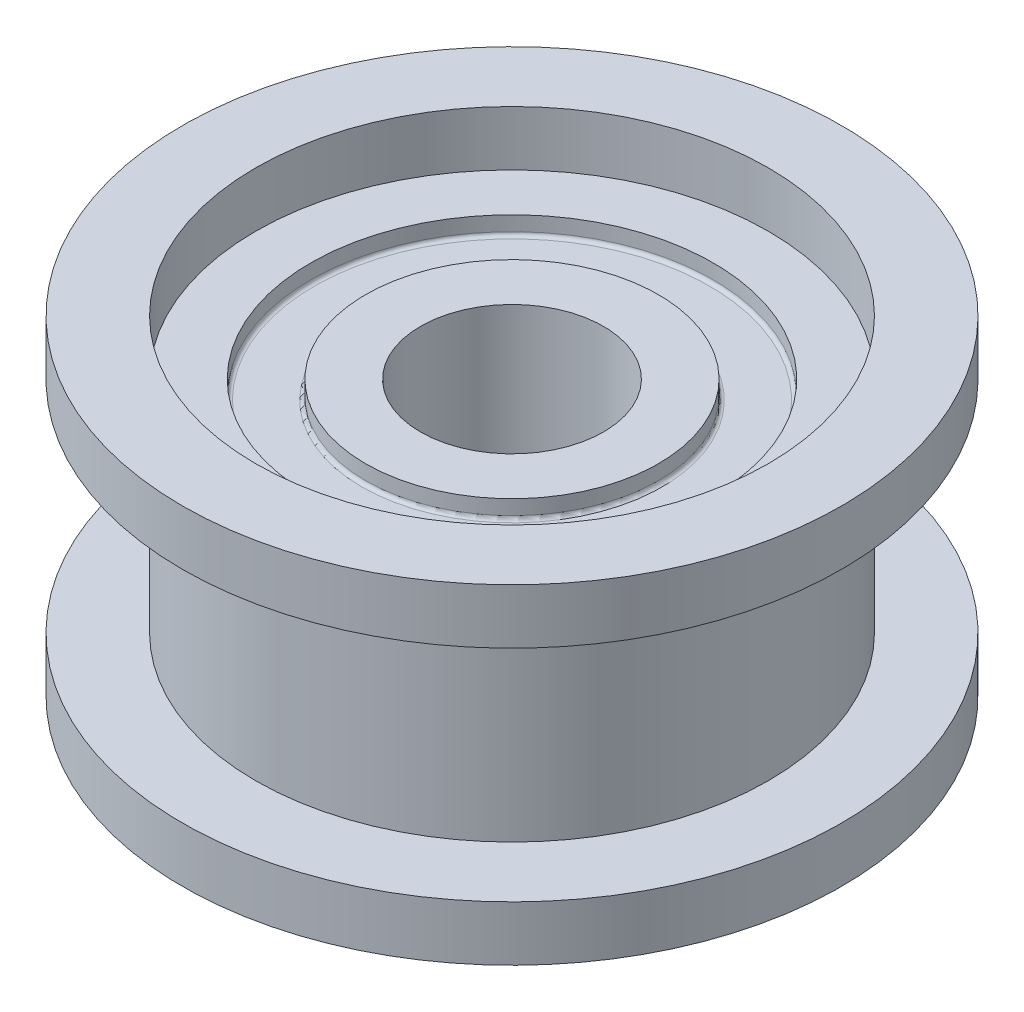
ISO-10303-21;
HEADER;
FILE_DESCRIPTION(('STEP AP214'),'2;1');
FILE_NAME('part.step','',(''),(''),'','','');
FILE_SCHEMA(('AUTOMOTIVE_DESIGN { 1 0 10303 214 1 1 1 1 }'));
ENDSEC;
DATA;
#1=APPLICATION_CONTEXT('core data for automotive mechanical design processes');
#2=APPLICATION_PROTOCOL_DEFINITION('international standard','automotive_design',2000,#1);
#3=PRODUCT_CONTEXT('',#1,'mechanical');
#4=PRODUCT('Part','Part','',(#3));
#5=PRODUCT_RELATED_PRODUCT_CATEGORY('part','',(#4));
#6=PRODUCT_DEFINITION_FORMATION('','',#4);
#7=PRODUCT_DEFINITION_CONTEXT('part definition',#1,'design');
#8=PRODUCT_DEFINITION('design','',#6,#7);
#9=PRODUCT_DEFINITION_SHAPE('','',#8);
#10=(LENGTH_UNIT() NAMED_UNIT(*) SI_UNIT(.MILLI.,.METRE.));
#11=(NAMED_UNIT(*) PLANE_ANGLE_UNIT() SI_UNIT($,.RADIAN.));
#12=(NAMED_UNIT(*) SI_UNIT($,.STERADIAN.) SOLID_ANGLE_UNIT());
#13=UNCERTAINTY_MEASURE_WITH_UNIT(LENGTH_MEASURE(1.E-05),#10,'distance_accuracy_value','');
#14=(GEOMETRIC_REPRESENTATION_CONTEXT(3) GLOBAL_UNCERTAINTY_ASSIGNED_CONTEXT((#13)) GLOBAL_UNIT_ASSIGNED_CONTEXT((#10,
#11,#12)) REPRESENTATION_CONTEXT('',''));
#15=CARTESIAN_POINT('',(0.,0.,0.));
#16=DIRECTION('',(0.,0.,1.));
#17=DIRECTION('',(1.,0.,0.));
#18=AXIS2_PLACEMENT_3D('',#15,#16,#17);
#19=CARTESIAN_POINT('',(0.,7.5,0.));
#20=DIRECTION('',(0.,1.,0.));
#21=DIRECTION('',(0.,0.,1.));
#22=AXIS2_PLACEMENT_3D('',#19,#20,#21);
#23=PLANE('',#22);
#24=CARTESIAN_POINT('',(0.,7.5,0.));
#25=DIRECTION('',(0.,1.,0.));
#26=DIRECTION('',(0.,0.,1.));
#27=AXIS2_PLACEMENT_3D('',#24,#25,#26);
#28=CIRCLE('',#27,9.);
#29=CARTESIAN_POINT('',(0.,7.5,9.));
#30=VERTEX_POINT('',#29);
#31=EDGE_CURVE('E11',#30,#30,#28,.T.);
#32=ORIENTED_EDGE('',*,*,#31,.T.);
#33=EDGE_LOOP('',(#32));
#34=FACE_BOUND('',#33,.T.);
#35=CARTESIAN_POINT('',(0.,7.5,0.));
#36=DIRECTION('',(0.,1.,0.));
#37=DIRECTION('',(0.,0.,1.));
#38=AXIS2_PLACEMENT_3D('',#35,#36,#37);
#39=CIRCLE('',#38,7.);
#40=CARTESIAN_POINT('',(0.,7.5,7.));
#41=VERTEX_POINT('',#40);
#42=EDGE_CURVE('E53',#41,#41,#39,.T.);
#43=ORIENTED_EDGE('',*,*,#42,.F.);
#44=EDGE_LOOP('',(#43));
#45=FACE_BOUND('',#44,.T.);
#46=ADVANCED_FACE('F42',(#34,#45),#23,.T.);
#47=CARTESIAN_POINT('',(0.,6.,0.));
#48=DIRECTION('',(0.,1.,0.));
#49=DIRECTION('',(0.,0.,1.));
#50=AXIS2_PLACEMENT_3D('',#47,#48,#49);
#51=PLANE('',#50);
#52=CARTESIAN_POINT('',(0.,6.,0.));
#53=DIRECTION('',(0.,1.,0.));
#54=DIRECTION('',(0.,0.,1.));
#55=AXIS2_PLACEMENT_3D('',#52,#53,#54);
#56=CIRCLE('',#55,9.);
#57=CARTESIAN_POINT('',(0.,6.,9.));
#58=VERTEX_POINT('',#57);
#59=EDGE_CURVE('E46',#58,#58,#56,.T.);
#60=ORIENTED_EDGE('',*,*,#59,.F.);
#61=EDGE_LOOP('',(#60));
#62=FACE_BOUND('',#61,.T.);
#63=CARTESIAN_POINT('',(0.,6.,0.));
#64=DIRECTION('',(0.,1.,0.));
#65=DIRECTION('',(0.,0.,1.));
#66=AXIS2_PLACEMENT_3D('',#63,#64,#65);
#67=CIRCLE('',#66,7.);
#68=CARTESIAN_POINT('',(0.,6.,7.));
#69=VERTEX_POINT('',#68);
#70=EDGE_CURVE('E55',#69,#69,#67,.T.);
#71=ORIENTED_EDGE('',*,*,#70,.T.);
#72=EDGE_LOOP('',(#71));
#73=FACE_BOUND('',#72,.T.);
#74=ADVANCED_FACE('F65',(#62,#73),#51,.F.);
#75=CARTESIAN_POINT('',(0.,7.5,0.));
#76=DIRECTION('',(0.,-1.,0.));
#77=DIRECTION('',(0.,0.,-1.));
#78=AXIS2_PLACEMENT_3D('',#75,#76,#77);
#79=CYLINDRICAL_SURFACE('',#78,9.);
#80=ORIENTED_EDGE('',*,*,#31,.F.);
#81=EDGE_LOOP('',(#80));
#82=FACE_BOUND('',#81,.T.);
#83=ORIENTED_EDGE('',*,*,#59,.T.);
#84=EDGE_LOOP('',(#83));
#85=FACE_BOUND('',#84,.T.);
#86=ADVANCED_FACE('F44',(#82,#85),#79,.T.);
#87=CARTESIAN_POINT('',(0.,7.5,0.));
#88=DIRECTION('',(0.,-1.,0.));
#89=DIRECTION('',(0.,0.,-1.));
#90=AXIS2_PLACEMENT_3D('',#87,#88,#89);
#91=CYLINDRICAL_SURFACE('',#90,7.);
#92=ORIENTED_EDGE('',*,*,#42,.T.);
#93=EDGE_LOOP('',(#92));
#94=FACE_BOUND('',#93,.T.);
#95=ORIENTED_EDGE('',*,*,#70,.F.);
#96=EDGE_LOOP('',(#95));
#97=FACE_BOUND('',#96,.T.);
#98=ADVANCED_FACE('F61',(#94,#97),#91,.F.);
#99=CLOSED_SHELL('',(#46,#74,#86,#98));
#100=MANIFOLD_SOLID_BREP('B2',#99);
#101=CARTESIAN_POINT('',(0.,0.,0.));
#102=DIRECTION('',(0.,1.,0.));
#103=DIRECTION('',(0.,0.,1.));
#104=AXIS2_PLACEMENT_3D('',#101,#102,#103);
#105=PLANE('',#104);
#106=CARTESIAN_POINT('',(0.,0.,0.));
#107=DIRECTION('',(0.,1.,0.));
#108=DIRECTION('',(0.,0.,1.));
#109=AXIS2_PLACEMENT_3D('',#106,#107,#108);
#110=CIRCLE('',#109,2.5);
#111=CARTESIAN_POINT('',(0.,0.,2.5));
#112=VERTEX_POINT('',#111);
#113=EDGE_CURVE('E139',#112,#112,#110,.T.);
#114=ORIENTED_EDGE('',*,*,#113,.T.);
#115=EDGE_LOOP('',(#114));
#116=FACE_BOUND('',#115,.T.);
#117=CARTESIAN_POINT('',(0.,0.,0.));
#118=DIRECTION('',(0.,-1.,0.));
#119=DIRECTION('',(0.,0.,-1.));
#120=AXIS2_PLACEMENT_3D('',#117,#118,#119);
#121=CIRCLE('',#120,4.);
#122=CARTESIAN_POINT('',(0.,0.,-4.));
#123=VERTEX_POINT('',#122);
#124=EDGE_CURVE('E150',#123,#123,#121,.T.);
#125=ORIENTED_EDGE('',*,*,#124,.T.);
#126=EDGE_LOOP('',(#125));
#127=FACE_BOUND('',#126,.T.);
#128=ADVANCED_FACE('F103',(#116,#127),#105,.F.);
#129=CARTESIAN_POINT('',(0.,6.,0.));
#130=DIRECTION('',(0.,1.,0.));
#131=DIRECTION('',(0.,0.,1.));
#132=AXIS2_PLACEMENT_3D('',#129,#130,#131);
#133=PLANE('',#132);
#134=CARTESIAN_POINT('',(0.,6.,0.));
#135=DIRECTION('',(0.,1.,0.));
#136=DIRECTION('',(0.,0.,1.));
#137=AXIS2_PLACEMENT_3D('',#134,#135,#136);
#138=CIRCLE('',#137,2.5);
#139=CARTESIAN_POINT('',(0.,6.,2.5));
#140=VERTEX_POINT('',#139);
#141=EDGE_CURVE('E138',#140,#140,#138,.T.);
#142=ORIENTED_EDGE('',*,*,#141,.F.);
#143=EDGE_LOOP('',(#142));
#144=FACE_BOUND('',#143,.T.);
#145=CARTESIAN_POINT('',(0.,6.,0.));
#146=DIRECTION('',(0.,1.,0.));
#147=DIRECTION('',(0.,0.,1.));
#148=AXIS2_PLACEMENT_3D('',#145,#146,#147);
#149=CIRCLE('',#148,4.);
#150=CARTESIAN_POINT('',(0.,6.,4.));
#151=VERTEX_POINT('',#150);
#152=EDGE_CURVE('E147',#151,#151,#149,.T.);
#153=ORIENTED_EDGE('',*,*,#152,.T.);
#154=EDGE_LOOP('',(#153));
#155=FACE_BOUND('',#154,.T.);
#156=ADVANCED_FACE('F184',(#144,#155),#133,.T.);
#157=CARTESIAN_POINT('',(0.,6.,0.));
#158=DIRECTION('',(0.,1.,0.));
#159=DIRECTION('',(0.,0.,1.));
#160=AXIS2_PLACEMENT_3D('',#157,#158,#159);
#161=CIRCLE('',#160,5.5);
#162=CARTESIAN_POINT('',(0.,6.,5.5));
#163=VERTEX_POINT('',#162);
#164=EDGE_CURVE('E142',#163,#163,#161,.T.);
#165=ORIENTED_EDGE('',*,*,#164,.F.);
#166=EDGE_LOOP('',(#165));
#167=FACE_BOUND('',#166,.T.);
#168=CARTESIAN_POINT('',(0.,6.,0.));
#169=DIRECTION('',(0.,1.,0.));
#170=DIRECTION('',(0.,0.,1.));
#171=AXIS2_PLACEMENT_3D('',#168,#169,#170);
#172=CIRCLE('',#171,7.);
#173=CARTESIAN_POINT('',(0.,6.,7.));
#174=VERTEX_POINT('',#173);
#175=EDGE_CURVE('E135',#174,#174,#172,.T.);
#176=ORIENTED_EDGE('',*,*,#175,.T.);
#177=EDGE_LOOP('',(#176));
#178=FACE_BOUND('',#177,.T.);
#179=ADVANCED_FACE('F190',(#167,#178),#133,.T.);
#180=CARTESIAN_POINT('',(0.,6.,0.));
#181=DIRECTION('',(0.,-1.,0.));
#182=DIRECTION('',(0.,0.,-1.));
#183=AXIS2_PLACEMENT_3D('',#180,#181,#182);
#184=CYLINDRICAL_SURFACE('',#183,7.);
#185=ORIENTED_EDGE('',*,*,#175,.F.);
#186=EDGE_LOOP('',(#185));
#187=FACE_BOUND('',#186,.T.);
#188=CARTESIAN_POINT('',(0.,0.,0.));
#189=DIRECTION('',(0.,-1.,0.));
#190=DIRECTION('',(0.,0.,-1.));
#191=AXIS2_PLACEMENT_3D('',#188,#189,#190);
#192=CIRCLE('',#191,7.);
#193=CARTESIAN_POINT('',(0.,0.,-7.));
#194=VERTEX_POINT('',#193);
#195=EDGE_CURVE('E153',#194,#194,#192,.T.);
#196=ORIENTED_EDGE('',*,*,#195,.F.);
#197=EDGE_LOOP('',(#196));
#198=FACE_BOUND('',#197,.T.);
#199=ADVANCED_FACE('F196',(#187,#198),#184,.T.);
#200=CARTESIAN_POINT('',(0.,6.,0.));
#201=DIRECTION('',(0.,-1.,0.));
#202=DIRECTION('',(0.,0.,-1.));
#203=AXIS2_PLACEMENT_3D('',#200,#201,#202);
#204=CYLINDRICAL_SURFACE('',#203,2.5);
#205=ORIENTED_EDGE('',*,*,#141,.T.);
#206=EDGE_LOOP('',(#205));
#207=FACE_BOUND('',#206,.T.);
#208=ORIENTED_EDGE('',*,*,#113,.F.);
#209=EDGE_LOOP('',(#208));
#210=FACE_BOUND('',#209,.T.);
#211=ADVANCED_FACE('F199',(#207,#210),#204,.F.);
#212=CARTESIAN_POINT('',(0.,5.5,0.));
#213=DIRECTION('',(0.,1.,0.));
#214=DIRECTION('',(0.,0.,1.));
#215=AXIS2_PLACEMENT_3D('',#212,#213,#214);
#216=CYLINDRICAL_SURFACE('',#215,5.5);
#217=CARTESIAN_POINT('',(0.,5.6,0.));
#218=DIRECTION('',(0.,1.,0.));
#219=DIRECTION('',(0.,0.,1.));
#220=AXIS2_PLACEMENT_3D('',#217,#218,#219);
#221=CIRCLE('',#220,5.5);
#222=CARTESIAN_POINT('',(0.,5.6,5.5));
#223=VERTEX_POINT('',#222);
#224=EDGE_CURVE('E126',#223,#223,#221,.F.);
#225=ORIENTED_EDGE('',*,*,#224,.T.);
#226=EDGE_LOOP('',(#225));
#227=FACE_BOUND('',#226,.T.);
#228=ORIENTED_EDGE('',*,*,#164,.T.);
#229=EDGE_LOOP('',(#228));
#230=FACE_BOUND('',#229,.T.);
#231=ADVANCED_FACE('F239',(#227,#230),#216,.F.);
#232=CARTESIAN_POINT('',(0.,5.5,0.));
#233=DIRECTION('',(0.,1.,0.));
#234=DIRECTION('',(0.,0.,1.));
#235=AXIS2_PLACEMENT_3D('',#232,#233,#234);
#236=PLANE('',#235);
#237=CARTESIAN_POINT('',(0.,5.5,0.));
#238=DIRECTION('',(0.,1.,0.));
#239=DIRECTION('',(0.,0.,1.));
#240=AXIS2_PLACEMENT_3D('',#237,#238,#239);
#241=CIRCLE('',#240,5.4);
#242=CARTESIAN_POINT('',(0.,5.5,5.4));
#243=VERTEX_POINT('',#242);
#244=EDGE_CURVE('E129',#243,#243,#241,.T.);
#245=ORIENTED_EDGE('',*,*,#244,.T.);
#246=EDGE_LOOP('',(#245));
#247=FACE_BOUND('',#246,.T.);
#248=CARTESIAN_POINT('',(0.,5.5,0.));
#249=DIRECTION('',(0.,1.,0.));
#250=DIRECTION('',(0.,0.,1.));
#251=AXIS2_PLACEMENT_3D('',#248,#249,#250);
#252=CIRCLE('',#251,4.1);
#253=CARTESIAN_POINT('',(0.,5.5,4.1));
#254=VERTEX_POINT('',#253);
#255=EDGE_CURVE('E132',#254,#254,#252,.F.);
#256=ORIENTED_EDGE('',*,*,#255,.T.);
#257=EDGE_LOOP('',(#256));
#258=FACE_BOUND('',#257,.T.);
#259=ADVANCED_FACE('F235',(#247,#258),#236,.T.);
#260=CARTESIAN_POINT('',(0.,5.5,0.));
#261=DIRECTION('',(0.,1.,0.));
#262=DIRECTION('',(0.,0.,1.));
#263=AXIS2_PLACEMENT_3D('',#260,#261,#262);
#264=CYLINDRICAL_SURFACE('',#263,4.);
#265=CARTESIAN_POINT('',(0.,5.6,0.));
#266=DIRECTION('',(0.,1.,0.));
#267=DIRECTION('',(0.,0.,1.));
#268=AXIS2_PLACEMENT_3D('',#265,#266,#267);
#269=CIRCLE('',#268,4.);
#270=CARTESIAN_POINT('',(0.,5.6,4.));
#271=VERTEX_POINT('',#270);
#272=EDGE_CURVE('E123',#271,#271,#269,.T.);
#273=ORIENTED_EDGE('',*,*,#272,.T.);
#274=EDGE_LOOP('',(#273));
#275=FACE_BOUND('',#274,.T.);
#276=ORIENTED_EDGE('',*,*,#152,.F.);
#277=EDGE_LOOP('',(#276));
#278=FACE_BOUND('',#277,.T.);
#279=ADVANCED_FACE('F230',(#275,#278),#264,.T.);
#280=CARTESIAN_POINT('',(0.,0.5,0.));
#281=DIRECTION('',(0.,-1.,0.));
#282=DIRECTION('',(0.,0.,-1.));
#283=AXIS2_PLACEMENT_3D('',#280,#281,#282);
#284=CYLINDRICAL_SURFACE('',#283,5.5);
#285=CARTESIAN_POINT('',(0.,0.4,0.));
#286=DIRECTION('',(0.,-1.,0.));
#287=DIRECTION('',(0.,0.,-1.));
#288=AXIS2_PLACEMENT_3D('',#285,#286,#287);
#289=CIRCLE('',#288,5.5);
#290=CARTESIAN_POINT('',(0.,0.4,-5.5));
#291=VERTEX_POINT('',#290);
#292=EDGE_CURVE('E110',#291,#291,#289,.F.);
#293=ORIENTED_EDGE('',*,*,#292,.T.);
#294=EDGE_LOOP('',(#293));
#295=FACE_BOUND('',#294,.T.);
#296=CARTESIAN_POINT('',(0.,-1.5,0.));
#297=DIRECTION('',(0.,-1.,0.));
#298=DIRECTION('',(0.,0.,-1.));
#299=AXIS2_PLACEMENT_3D('',#296,#297,#298);
#300=CIRCLE('',#299,5.5);
#301=CARTESIAN_POINT('',(0.,-1.5,-5.5));
#302=VERTEX_POINT('',#301);
#303=EDGE_CURVE('E160',#302,#302,#300,.T.);
#304=ORIENTED_EDGE('',*,*,#303,.T.);
#305=EDGE_LOOP('',(#304));
#306=FACE_BOUND('',#305,.T.);
#307=ADVANCED_FACE('F167',(#295,#306),#284,.F.);
#308=CARTESIAN_POINT('',(0.,0.5,0.));
#309=DIRECTION('',(0.,-1.,0.));
#310=DIRECTION('',(0.,0.,-1.));
#311=AXIS2_PLACEMENT_3D('',#308,#309,#310);
#312=PLANE('',#311);
#313=CARTESIAN_POINT('',(0.,0.5,0.));
#314=DIRECTION('',(0.,-1.,0.));
#315=DIRECTION('',(0.,0.,-1.));
#316=AXIS2_PLACEMENT_3D('',#313,#314,#315);
#317=CIRCLE('',#316,5.4);
#318=CARTESIAN_POINT('',(0.,0.5,-5.4));
#319=VERTEX_POINT('',#318);
#320=EDGE_CURVE('E114',#319,#319,#317,.T.);
#321=ORIENTED_EDGE('',*,*,#320,.T.);
#322=EDGE_LOOP('',(#321));
#323=FACE_BOUND('',#322,.T.);
#324=CARTESIAN_POINT('',(0.,0.5,0.));
#325=DIRECTION('',(0.,-1.,0.));
#326=DIRECTION('',(0.,0.,-1.));
#327=AXIS2_PLACEMENT_3D('',#324,#325,#326);
#328=CIRCLE('',#327,4.1);
#329=CARTESIAN_POINT('',(0.,0.5,-4.1));
#330=VERTEX_POINT('',#329);
#331=EDGE_CURVE('E118',#330,#330,#328,.F.);
#332=ORIENTED_EDGE('',*,*,#331,.T.);
#333=EDGE_LOOP('',(#332));
#334=FACE_BOUND('',#333,.T.);
#335=ADVANCED_FACE('F219',(#323,#334),#312,.T.);
#336=CARTESIAN_POINT('',(0.,0.5,0.));
#337=DIRECTION('',(0.,-1.,0.));
#338=DIRECTION('',(0.,0.,-1.));
#339=AXIS2_PLACEMENT_3D('',#336,#337,#338);
#340=CYLINDRICAL_SURFACE('',#339,4.);
#341=CARTESIAN_POINT('',(0.,0.4,0.));
#342=DIRECTION('',(0.,-1.,0.));
#343=DIRECTION('',(0.,0.,-1.));
#344=AXIS2_PLACEMENT_3D('',#341,#342,#343);
#345=CIRCLE('',#344,4.);
#346=CARTESIAN_POINT('',(0.,0.4,-4.));
#347=VERTEX_POINT('',#346);
#348=EDGE_CURVE('E41',#347,#347,#345,.T.);
#349=ORIENTED_EDGE('',*,*,#348,.T.);
#350=EDGE_LOOP('',(#349));
#351=FACE_BOUND('',#350,.T.);
#352=ORIENTED_EDGE('',*,*,#124,.F.);
#353=EDGE_LOOP('',(#352));
#354=FACE_BOUND('',#353,.T.);
#355=ADVANCED_FACE('F205',(#351,#354),#340,.T.);
#356=CARTESIAN_POINT('',(0.,5.6,0.));
#357=DIRECTION('',(0.,1.,0.));
#358=DIRECTION('',(0.,0.,1.));
#359=AXIS2_PLACEMENT_3D('',#356,#357,#358);
#360=TOROIDAL_SURFACE('',#359,5.4,0.1);
#361=ORIENTED_EDGE('',*,*,#224,.F.);
#362=EDGE_LOOP('',(#361));
#363=FACE_BOUND('',#362,.T.);
#364=ORIENTED_EDGE('',*,*,#244,.F.);
#365=EDGE_LOOP('',(#364));
#366=FACE_BOUND('',#365,.T.);
#367=ADVANCED_FACE('F201',(#363,#366),#360,.F.);
#368=CARTESIAN_POINT('',(0.,5.6,0.));
#369=DIRECTION('',(0.,1.,0.));
#370=DIRECTION('',(0.,0.,1.));
#371=AXIS2_PLACEMENT_3D('',#368,#369,#370);
#372=TOROIDAL_SURFACE('',#371,4.1,0.1);
#373=ORIENTED_EDGE('',*,*,#255,.F.);
#374=EDGE_LOOP('',(#373));
#375=FACE_BOUND('',#374,.T.);
#376=ORIENTED_EDGE('',*,*,#272,.F.);
#377=EDGE_LOOP('',(#376));
#378=FACE_BOUND('',#377,.T.);
#379=ADVANCED_FACE('F204',(#375,#378),#372,.F.);
#380=CARTESIAN_POINT('',(0.,0.4,0.));
#381=DIRECTION('',(0.,-1.,0.));
#382=DIRECTION('',(0.,0.,-1.));
#383=AXIS2_PLACEMENT_3D('',#380,#381,#382);
#384=TOROIDAL_SURFACE('',#383,5.4,0.1);
#385=ORIENTED_EDGE('',*,*,#292,.F.);
#386=EDGE_LOOP('',(#385));
#387=FACE_BOUND('',#386,.T.);
#388=ORIENTED_EDGE('',*,*,#320,.F.);
#389=EDGE_LOOP('',(#388));
#390=FACE_BOUND('',#389,.T.);
#391=ADVANCED_FACE('F208',(#387,#390),#384,.F.);
#392=CARTESIAN_POINT('',(0.,0.4,0.));
#393=DIRECTION('',(0.,-1.,0.));
#394=DIRECTION('',(0.,0.,-1.));
#395=AXIS2_PLACEMENT_3D('',#392,#393,#394);
#396=TOROIDAL_SURFACE('',#395,4.1,0.1);
#397=ORIENTED_EDGE('',*,*,#331,.F.);
#398=EDGE_LOOP('',(#397));
#399=FACE_BOUND('',#398,.T.);
#400=ORIENTED_EDGE('',*,*,#348,.F.);
#401=EDGE_LOOP('',(#400));
#402=FACE_BOUND('',#401,.T.);
#403=ADVANCED_FACE('F105',(#399,#402),#396,.F.);
#404=CARTESIAN_POINT('',(0.,0.,0.));
#405=DIRECTION('',(0.,-1.,0.));
#406=DIRECTION('',(0.,0.,-1.));
#407=AXIS2_PLACEMENT_3D('',#404,#405,#406);
#408=PLANE('',#407);
#409=CARTESIAN_POINT('',(0.,0.,0.));
#410=DIRECTION('',(0.,-1.,0.));
#411=DIRECTION('',(0.,0.,-1.));
#412=AXIS2_PLACEMENT_3D('',#409,#410,#411);
#413=CIRCLE('',#412,9.);
#414=CARTESIAN_POINT('',(0.,0.,-9.));
#415=VERTEX_POINT('',#414);
#416=EDGE_CURVE('E157',#415,#415,#413,.T.);
#417=ORIENTED_EDGE('',*,*,#416,.F.);
#418=EDGE_LOOP('',(#417));
#419=FACE_BOUND('',#418,.T.);
#420=ORIENTED_EDGE('',*,*,#195,.T.);
#421=EDGE_LOOP('',(#420));
#422=FACE_BOUND('',#421,.T.);
#423=ADVANCED_FACE('F172',(#419,#422),#408,.F.);
#424=CARTESIAN_POINT('',(0.,-1.5,0.));
#425=DIRECTION('',(0.,-1.,0.));
#426=DIRECTION('',(0.,0.,-1.));
#427=AXIS2_PLACEMENT_3D('',#424,#425,#426);
#428=PLANE('',#427);
#429=CARTESIAN_POINT('',(0.,-1.5,0.));
#430=DIRECTION('',(0.,-1.,0.));
#431=DIRECTION('',(0.,0.,-1.));
#432=AXIS2_PLACEMENT_3D('',#429,#430,#431);
#433=CIRCLE('',#432,9.);
#434=CARTESIAN_POINT('',(0.,-1.5,-9.));
#435=VERTEX_POINT('',#434);
#436=EDGE_CURVE('E156',#435,#435,#433,.T.);
#437=ORIENTED_EDGE('',*,*,#436,.T.);
#438=EDGE_LOOP('',(#437));
#439=FACE_BOUND('',#438,.T.);
#440=ORIENTED_EDGE('',*,*,#303,.F.);
#441=EDGE_LOOP('',(#440));
#442=FACE_BOUND('',#441,.T.);
#443=ADVANCED_FACE('F169',(#439,#442),#428,.T.);
#444=CARTESIAN_POINT('',(0.,-1.5,0.));
#445=DIRECTION('',(0.,1.,0.));
#446=DIRECTION('',(0.,0.,1.));
#447=AXIS2_PLACEMENT_3D('',#444,#445,#446);
#448=CYLINDRICAL_SURFACE('',#447,9.);
#449=ORIENTED_EDGE('',*,*,#436,.F.);
#450=EDGE_LOOP('',(#449));
#451=FACE_BOUND('',#450,.T.);
#452=ORIENTED_EDGE('',*,*,#416,.T.);
#453=EDGE_LOOP('',(#452));
#454=FACE_BOUND('',#453,.T.);
#455=ADVANCED_FACE('F171',(#451,#454),#448,.T.);
#456=CLOSED_SHELL('',(#128,#156,#179,#199,#211,#231,#259,#279,#307,#335,#355,#367,#379,#391,
#403,#423,#443,#455));
#457=MANIFOLD_SOLID_BREP('B6',#456);
#458=ADVANCED_BREP_SHAPE_REPRESENTATION('',(#18,#100,#457),#14);
#459=SHAPE_DEFINITION_REPRESENTATION(#9,#458);
ENDSEC;
END-ISO-10303-21;
